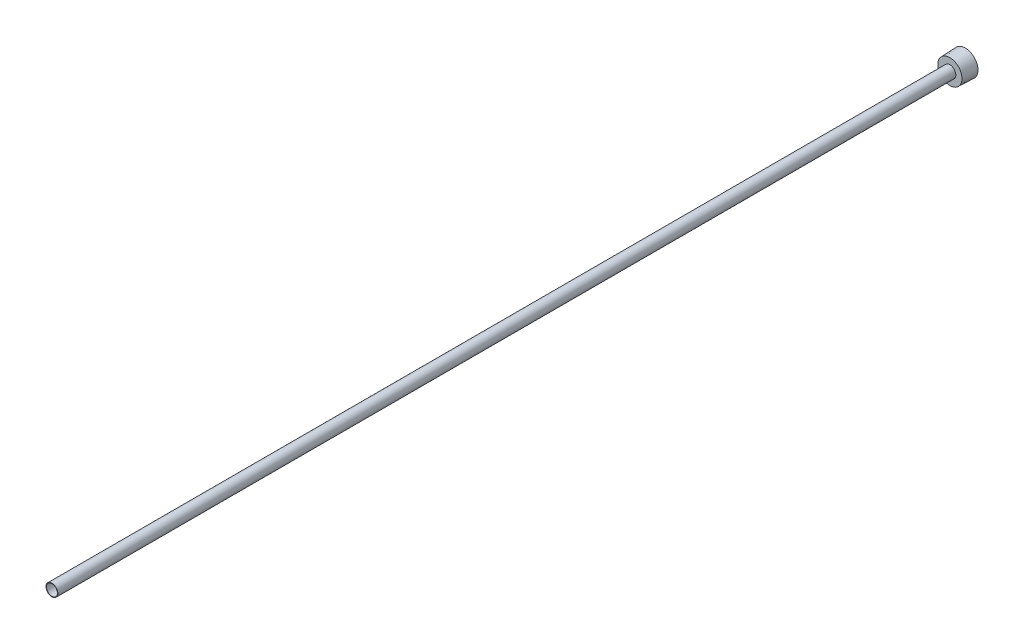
from build123d import *

# Parameters (mm, degrees)
SKETCH2_R          = 3.6576
CUT_EXTRUDE1_DEPTH = 610.717698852
CUT_EXTRUDE2_DEPTH = 6.35


with BuildPart() as part:
    # Sketch1 → Revolve1 (revolve)
    with BuildSketch(Plane(origin=(0, 0, 0), x_dir=(0, 0, -1), z_dir=(1, 0, 0)), mode=Mode.PRIVATE) as revolve1_sk:
        Polygon((0, 0), (0, 8.4709), (-10.3124, 8.094743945), (-10.3124, 3.9624), (-609.6, 3.9624), (-609.6, 0), align=None)
    revolve(revolve1_sk.sketch.rotate(Axis((0, 0, 168.793426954), (0, 0, -1)), 90), axis=Axis((0, 0, 168.793426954), (0, 0, -1)))

    # Sketch2 → Cut-Extrude1 (cut, through all)
    with BuildSketch(Plane.XY.offset(609.6)):
        Circle(SKETCH2_R)
    extrude(amount=-CUT_EXTRUDE1_DEPTH, mode=Mode.SUBTRACT)

    # Sketch3 → Cut-Extrude2 (cut)
    with BuildSketch(Plane(origin=(0, 0, 0), x_dir=(-1, 0, 0), z_dir=(0, 0, -1))):
        Polygon((-4.7625, -2.749630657), (0, -5.499261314), (4.7625, -2.749630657), (4.7625, 2.749630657), (0, 5.499261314), (-4.7625, 2.749630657), align=None)
    extrude(amount=-CUT_EXTRUDE2_DEPTH, mode=Mode.SUBTRACT)


solid = part.part
